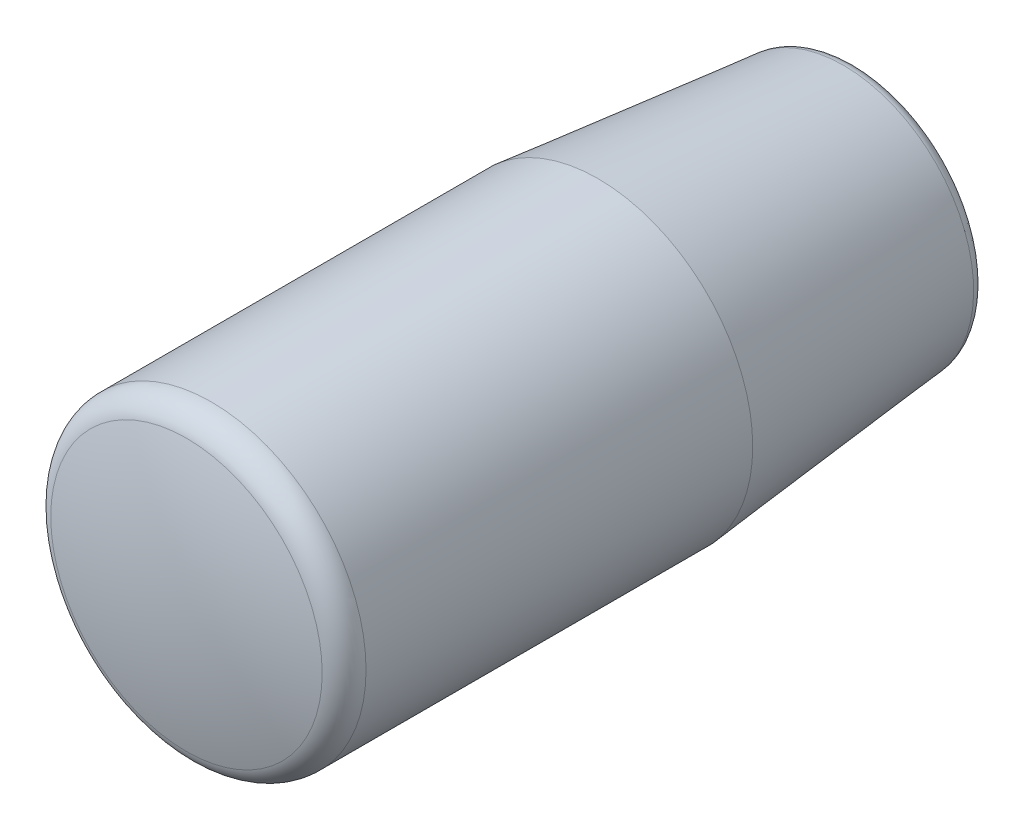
ISO-10303-21;
HEADER;
FILE_DESCRIPTION(('STEP AP214'),'2;1');
FILE_NAME('part.step','',(''),(''),'','','');
FILE_SCHEMA(('AUTOMOTIVE_DESIGN { 1 0 10303 214 1 1 1 1 }'));
ENDSEC;
DATA;
#1=APPLICATION_CONTEXT('core data for automotive mechanical design processes');
#2=APPLICATION_PROTOCOL_DEFINITION('international standard','automotive_design',2000,#1);
#3=PRODUCT_CONTEXT('',#1,'mechanical');
#4=PRODUCT('Part','Part','',(#3));
#5=PRODUCT_RELATED_PRODUCT_CATEGORY('part','',(#4));
#6=PRODUCT_DEFINITION_FORMATION('','',#4);
#7=PRODUCT_DEFINITION_CONTEXT('part definition',#1,'design');
#8=PRODUCT_DEFINITION('design','',#6,#7);
#9=PRODUCT_DEFINITION_SHAPE('','',#8);
#10=(LENGTH_UNIT() NAMED_UNIT(*) SI_UNIT(.MILLI.,.METRE.));
#11=(NAMED_UNIT(*) PLANE_ANGLE_UNIT() SI_UNIT($,.RADIAN.));
#12=(NAMED_UNIT(*) SI_UNIT($,.STERADIAN.) SOLID_ANGLE_UNIT());
#13=UNCERTAINTY_MEASURE_WITH_UNIT(LENGTH_MEASURE(1.E-05),#10,'distance_accuracy_value','');
#14=(GEOMETRIC_REPRESENTATION_CONTEXT(3) GLOBAL_UNCERTAINTY_ASSIGNED_CONTEXT((#13)) GLOBAL_UNIT_ASSIGNED_CONTEXT((#10,
#11,#12)) REPRESENTATION_CONTEXT('',''));
#15=CARTESIAN_POINT('',(0.,0.,0.));
#16=DIRECTION('',(0.,0.,1.));
#17=DIRECTION('',(1.,0.,0.));
#18=AXIS2_PLACEMENT_3D('',#15,#16,#17);
#19=CARTESIAN_POINT('',(0.,0.,10.));
#20=DIRECTION('',(0.,0.,-1.));
#21=DIRECTION('',(1.,0.,0.));
#22=AXIS2_PLACEMENT_3D('',#19,#20,#21);
#23=SPHERICAL_SURFACE('',#22,30.);
#24=CARTESIAN_POINT('',(0.,0.,38.9425833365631));
#25=DIRECTION('',(0.,0.,-1.));
#26=DIRECTION('',(0.,1.,0.));
#27=AXIS2_PLACEMENT_3D('',#24,#25,#26);
#28=CIRCLE('',#27,7.89473684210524);
#29=CARTESIAN_POINT('',(0.,7.89473684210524,38.9425833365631));
#30=VERTEX_POINT('',#29);
#31=EDGE_CURVE('E31',#30,#30,#28,.T.);
#32=ORIENTED_EDGE('',*,*,#31,.F.);
#33=EDGE_LOOP('',(#32));
#34=FACE_BOUND('',#33,.T.);
#35=ADVANCED_FACE('F12',(#34),#23,.T.);
#36=CARTESIAN_POINT('',(0.,0.,0.));
#37=DIRECTION('',(0.,0.,-1.));
#38=DIRECTION('',(0.,1.,0.));
#39=AXIS2_PLACEMENT_3D('',#36,#37,#38);
#40=PLANE('',#39);
#41=CARTESIAN_POINT('',(0.,0.,0.));
#42=DIRECTION('',(0.,0.,-1.));
#43=DIRECTION('',(0.,1.,0.));
#44=AXIS2_PLACEMENT_3D('',#41,#42,#43);
#45=CIRCLE('',#44,3.25);
#46=CARTESIAN_POINT('',(0.,3.25,0.));
#47=VERTEX_POINT('',#46);
#48=EDGE_CURVE('E43',#47,#47,#45,.T.);
#49=ORIENTED_EDGE('',*,*,#48,.F.);
#50=EDGE_LOOP('',(#49));
#51=FACE_BOUND('',#50,.T.);
#52=CARTESIAN_POINT('',(0.,0.,0.));
#53=DIRECTION('',(0.,0.,-1.));
#54=DIRECTION('',(0.,1.,0.));
#55=AXIS2_PLACEMENT_3D('',#52,#53,#54);
#56=CIRCLE('',#55,6.77600995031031);
#57=CARTESIAN_POINT('',(0.,6.77600995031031,0.));
#58=VERTEX_POINT('',#57);
#59=EDGE_CURVE('E8',#58,#58,#56,.T.);
#60=ORIENTED_EDGE('',*,*,#59,.T.);
#61=EDGE_LOOP('',(#60));
#62=FACE_BOUND('',#61,.T.);
#63=ADVANCED_FACE('F49',(#51,#62),#40,.T.);
#64=CARTESIAN_POINT('',(0.,0.,0.8));
#65=DIRECTION('',(0.,0.,-1.));
#66=DIRECTION('',(0.,1.,0.));
#67=AXIS2_PLACEMENT_3D('',#64,#65,#66);
#68=TOROIDAL_SURFACE('',#67,6.77600995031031,0.8);
#69=CARTESIAN_POINT('',(0.,0.,0.720397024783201));
#70=DIRECTION('',(0.,0.,-1.));
#71=DIRECTION('',(0.,1.,0.));
#72=AXIS2_PLACEMENT_3D('',#69,#70,#71);
#73=CIRCLE('',#72,7.5720397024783);
#74=CARTESIAN_POINT('',(0.,7.5720397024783,0.720397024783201));
#75=VERTEX_POINT('',#74);
#76=EDGE_CURVE('E18',#75,#75,#73,.T.);
#77=ORIENTED_EDGE('',*,*,#76,.T.);
#78=EDGE_LOOP('',(#77));
#79=FACE_BOUND('',#78,.T.);
#80=ORIENTED_EDGE('',*,*,#59,.F.);
#81=EDGE_LOOP('',(#80));
#82=FACE_BOUND('',#81,.T.);
#83=ADVANCED_FACE('F51',(#79,#82),#68,.T.);
#84=CARTESIAN_POINT('',(0.,0.,0.720397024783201));
#85=DIRECTION('',(0.,0.,1.));
#86=DIRECTION('',(0.,-1.,0.));
#87=AXIS2_PLACEMENT_3D('',#84,#85,#86);
#88=CONICAL_SURFACE('',#87,7.5720397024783,0.0996686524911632);
#89=CARTESIAN_POINT('',(0.,0.,15.));
#90=DIRECTION('',(0.,0.,-1.));
#91=DIRECTION('',(0.,1.,0.));
#92=AXIS2_PLACEMENT_3D('',#89,#90,#91);
#93=CIRCLE('',#92,9.);
#94=CARTESIAN_POINT('',(0.,9.,15.));
#95=VERTEX_POINT('',#94);
#96=EDGE_CURVE('E22',#95,#95,#93,.T.);
#97=ORIENTED_EDGE('',*,*,#96,.T.);
#98=EDGE_LOOP('',(#97));
#99=FACE_BOUND('',#98,.T.);
#100=ORIENTED_EDGE('',*,*,#76,.F.);
#101=EDGE_LOOP('',(#100));
#102=FACE_BOUND('',#101,.T.);
#103=ADVANCED_FACE('F58',(#99,#102),#88,.T.);
#104=CARTESIAN_POINT('',(0.,0.,0.));
#105=DIRECTION('',(0.,0.,-1.));
#106=DIRECTION('',(0.,1.,0.));
#107=AXIS2_PLACEMENT_3D('',#104,#105,#106);
#108=CYLINDRICAL_SURFACE('',#107,9.);
#109=CARTESIAN_POINT('',(0.,0.,37.4954541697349));
#110=DIRECTION('',(0.,0.,-1.));
#111=DIRECTION('',(0.,1.,0.));
#112=AXIS2_PLACEMENT_3D('',#109,#110,#111);
#113=CIRCLE('',#112,9.);
#114=CARTESIAN_POINT('',(0.,9.,37.4954541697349));
#115=VERTEX_POINT('',#114);
#116=EDGE_CURVE('E26',#115,#115,#113,.T.);
#117=ORIENTED_EDGE('',*,*,#116,.T.);
#118=EDGE_LOOP('',(#117));
#119=FACE_BOUND('',#118,.T.);
#120=ORIENTED_EDGE('',*,*,#96,.F.);
#121=EDGE_LOOP('',(#120));
#122=FACE_BOUND('',#121,.T.);
#123=ADVANCED_FACE('F64',(#119,#122),#108,.T.);
#124=CARTESIAN_POINT('',(0.,0.,37.4954541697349));
#125=DIRECTION('',(0.,0.,-1.));
#126=DIRECTION('',(0.,1.,0.));
#127=AXIS2_PLACEMENT_3D('',#124,#125,#126);
#128=TOROIDAL_SURFACE('',#127,7.5,1.5);
#129=ORIENTED_EDGE('',*,*,#31,.T.);
#130=EDGE_LOOP('',(#129));
#131=FACE_BOUND('',#130,.T.);
#132=ORIENTED_EDGE('',*,*,#116,.F.);
#133=EDGE_LOOP('',(#132));
#134=FACE_BOUND('',#133,.T.);
#135=ADVANCED_FACE('F68',(#131,#134),#128,.T.);
#136=CARTESIAN_POINT('',(0.,0.,0.));
#137=DIRECTION('',(0.,0.,-1.));
#138=DIRECTION('',(0.,1.,0.));
#139=AXIS2_PLACEMENT_3D('',#136,#137,#138);
#140=CYLINDRICAL_SURFACE('',#139,3.25);
#141=CARTESIAN_POINT('',(0.,0.,3.5));
#142=DIRECTION('',(0.,0.,-1.));
#143=DIRECTION('',(0.,1.,0.));
#144=AXIS2_PLACEMENT_3D('',#141,#142,#143);
#145=CIRCLE('',#144,3.25);
#146=CARTESIAN_POINT('',(0.,3.25,3.5));
#147=VERTEX_POINT('',#146);
#148=EDGE_CURVE('E34',#147,#147,#145,.T.);
#149=ORIENTED_EDGE('',*,*,#148,.F.);
#150=EDGE_LOOP('',(#149));
#151=FACE_BOUND('',#150,.T.);
#152=ORIENTED_EDGE('',*,*,#48,.T.);
#153=EDGE_LOOP('',(#152));
#154=FACE_BOUND('',#153,.T.);
#155=ADVANCED_FACE('F47',(#151,#154),#140,.F.);
#156=CARTESIAN_POINT('',(0.,3.25,3.5));
#157=DIRECTION('',(0.,0.,1.));
#158=DIRECTION('',(0.,-1.,0.));
#159=AXIS2_PLACEMENT_3D('',#156,#157,#158);
#160=PLANE('',#159);
#161=CARTESIAN_POINT('',(0.,0.,3.5));
#162=DIRECTION('',(0.,0.,-1.));
#163=DIRECTION('',(0.,1.,0.));
#164=AXIS2_PLACEMENT_3D('',#161,#162,#163);
#165=CIRCLE('',#164,3.);
#166=CARTESIAN_POINT('',(0.,3.,3.5));
#167=VERTEX_POINT('',#166);
#168=EDGE_CURVE('E37',#167,#167,#165,.T.);
#169=ORIENTED_EDGE('',*,*,#168,.F.);
#170=EDGE_LOOP('',(#169));
#171=FACE_BOUND('',#170,.T.);
#172=ORIENTED_EDGE('',*,*,#148,.T.);
#173=EDGE_LOOP('',(#172));
#174=FACE_BOUND('',#173,.T.);
#175=ADVANCED_FACE('F75',(#171,#174),#160,.F.);
#176=CARTESIAN_POINT('',(0.,0.,0.));
#177=DIRECTION('',(0.,0.,-1.));
#178=DIRECTION('',(0.,1.,0.));
#179=AXIS2_PLACEMENT_3D('',#176,#177,#178);
#180=CYLINDRICAL_SURFACE('',#179,3.);
#181=CARTESIAN_POINT('',(0.,0.,25.));
#182=DIRECTION('',(0.,0.,-1.));
#183=DIRECTION('',(0.,1.,0.));
#184=AXIS2_PLACEMENT_3D('',#181,#182,#183);
#185=CIRCLE('',#184,3.);
#186=CARTESIAN_POINT('',(0.,3.,25.));
#187=VERTEX_POINT('',#186);
#188=EDGE_CURVE('E40',#187,#187,#185,.T.);
#189=ORIENTED_EDGE('',*,*,#188,.F.);
#190=EDGE_LOOP('',(#189));
#191=FACE_BOUND('',#190,.T.);
#192=ORIENTED_EDGE('',*,*,#168,.T.);
#193=EDGE_LOOP('',(#192));
#194=FACE_BOUND('',#193,.T.);
#195=ADVANCED_FACE('F79',(#191,#194),#180,.F.);
#196=CARTESIAN_POINT('',(0.,3.,25.));
#197=DIRECTION('',(0.,0.,1.));
#198=DIRECTION('',(0.,-1.,0.));
#199=AXIS2_PLACEMENT_3D('',#196,#197,#198);
#200=PLANE('',#199);
#201=ORIENTED_EDGE('',*,*,#188,.T.);
#202=EDGE_LOOP('',(#201));
#203=FACE_BOUND('',#202,.T.);
#204=ADVANCED_FACE('F83',(#203),#200,.F.);
#205=CLOSED_SHELL('',(#35,#63,#83,#103,#123,#135,#155,#175,#195,#204));
#206=MANIFOLD_SOLID_BREP('B1',#205);
#207=ADVANCED_BREP_SHAPE_REPRESENTATION('',(#18,#206),#14);
#208=SHAPE_DEFINITION_REPRESENTATION(#9,#207);
ENDSEC;
END-ISO-10303-21;
